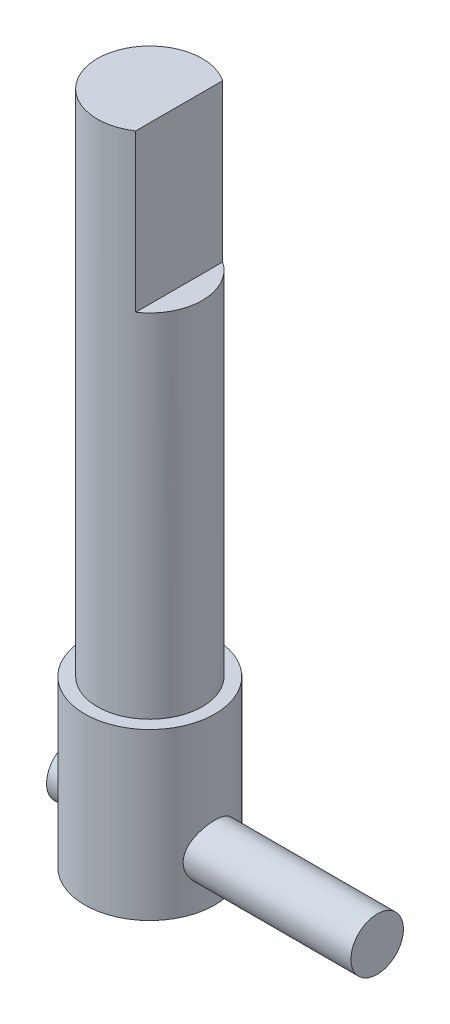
from build123d import *

# Parameters (mm, degrees)
CUT_EXTRUDE1_DEPTH       = 9.4996
BOSS_EXTRUDE1_DEPTH      = 13.7541
BOSS_EXTRUDE1_DEPTH_BACK = 4.6609
SKETCH3_R                = 1.5875


with BuildPart() as part:
    # Sketch1 → Revolve1 (revolve)
    with BuildSketch(Plane.XY, mode=Mode.PRIVATE) as revolve1_sk:
        Polygon((0, 0), (-3.937, 0), (-3.937, 10.0076), (-3.175, 10.0076), (-3.175, 40.7924), (0, 40.7924), align=None)
    revolve(revolve1_sk.sketch.rotate(Axis((0, 0, 0), (0, 1, 0)), 270), axis=Axis((0, 0, 0), (0, 1, 0)))

    # Sketch2 → Cut-Extrude1 (cut)
    with BuildSketch(Plane(origin=(0, 40.7924, 0), x_dir=(1, 0, 0), z_dir=(0, 1, 0))):
        with BuildLine():
            Line((1.778, 6.098442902), (1.778, -6.098442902))
            ThreePointArc((1.778, -6.098442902), (6.352345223, 0), (1.778, 6.098442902))
        make_face()
    extrude(amount=-CUT_EXTRUDE1_DEPTH, mode=Mode.SUBTRACT)

    # Sketch3 → Boss-Extrude1 (add, two sides: drawn at the far end of the back side and taken through both)
    with BuildSketch(Plane(origin=(0, 0, 0), x_dir=(0, 0, -1), z_dir=(1, 0, 0)).offset(-BOSS_EXTRUDE1_DEPTH_BACK)):
        with Locations((0, 2.8575)):
            Circle(SKETCH3_R)
    extrude(amount=BOSS_EXTRUDE1_DEPTH + BOSS_EXTRUDE1_DEPTH_BACK)


solid = part.part
